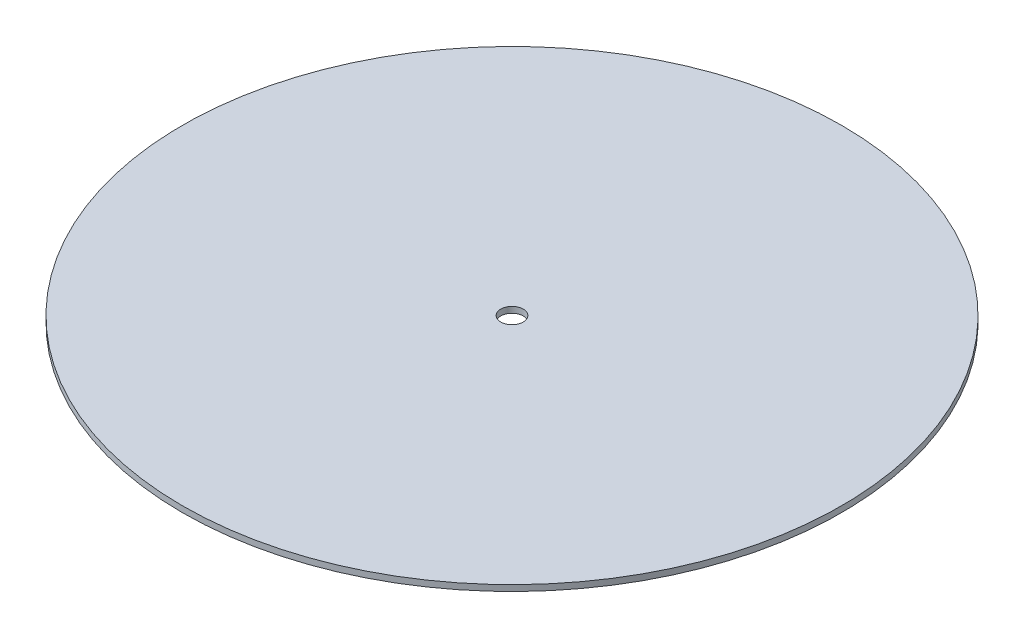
ISO-10303-21;
HEADER;
FILE_DESCRIPTION(('STEP AP214'),'2;1');
FILE_NAME('part.step','',(''),(''),'','','');
FILE_SCHEMA(('AUTOMOTIVE_DESIGN { 1 0 10303 214 1 1 1 1 }'));
ENDSEC;
DATA;
#1=APPLICATION_CONTEXT('core data for automotive mechanical design processes');
#2=APPLICATION_PROTOCOL_DEFINITION('international standard','automotive_design',2000,#1);
#3=PRODUCT_CONTEXT('',#1,'mechanical');
#4=PRODUCT('Part','Part','',(#3));
#5=PRODUCT_RELATED_PRODUCT_CATEGORY('part','',(#4));
#6=PRODUCT_DEFINITION_FORMATION('','',#4);
#7=PRODUCT_DEFINITION_CONTEXT('part definition',#1,'design');
#8=PRODUCT_DEFINITION('design','',#6,#7);
#9=PRODUCT_DEFINITION_SHAPE('','',#8);
#10=(LENGTH_UNIT() NAMED_UNIT(*) SI_UNIT(.MILLI.,.METRE.));
#11=(NAMED_UNIT(*) PLANE_ANGLE_UNIT() SI_UNIT($,.RADIAN.));
#12=(NAMED_UNIT(*) SI_UNIT($,.STERADIAN.) SOLID_ANGLE_UNIT());
#13=UNCERTAINTY_MEASURE_WITH_UNIT(LENGTH_MEASURE(1.E-05),#10,'distance_accuracy_value','');
#14=(GEOMETRIC_REPRESENTATION_CONTEXT(3) GLOBAL_UNCERTAINTY_ASSIGNED_CONTEXT((#13)) GLOBAL_UNIT_ASSIGNED_CONTEXT((#10,
#11,#12)) REPRESENTATION_CONTEXT('',''));
#15=CARTESIAN_POINT('',(0.,0.,0.));
#16=DIRECTION('',(0.,0.,1.));
#17=DIRECTION('',(1.,0.,0.));
#18=AXIS2_PLACEMENT_3D('',#15,#16,#17);
#19=CARTESIAN_POINT('',(0.,1.,0.));
#20=DIRECTION('',(0.,1.,0.));
#21=DIRECTION('',(0.,0.,1.));
#22=AXIS2_PLACEMENT_3D('',#19,#20,#21);
#23=PLANE('',#22);
#24=CARTESIAN_POINT('',(0.,1.,0.));
#25=DIRECTION('',(0.,1.,0.));
#26=DIRECTION('',(0.,0.,1.));
#27=AXIS2_PLACEMENT_3D('',#24,#25,#26);
#28=CIRCLE('',#27,110.);
#29=CARTESIAN_POINT('',(0.,1.,110.));
#30=VERTEX_POINT('',#29);
#31=EDGE_CURVE('E10',#30,#30,#28,.T.);
#32=ORIENTED_EDGE('',*,*,#31,.T.);
#33=EDGE_LOOP('',(#32));
#34=FACE_BOUND('',#33,.T.);
#35=CARTESIAN_POINT('',(0.,1.,0.));
#36=DIRECTION('',(0.,1.,0.));
#37=DIRECTION('',(0.,0.,1.));
#38=AXIS2_PLACEMENT_3D('',#35,#36,#37);
#39=CIRCLE('',#38,3.75);
#40=CARTESIAN_POINT('',(0.,1.,3.75));
#41=VERTEX_POINT('',#40);
#42=EDGE_CURVE('E42',#41,#41,#39,.T.);
#43=ORIENTED_EDGE('',*,*,#42,.F.);
#44=EDGE_LOOP('',(#43));
#45=FACE_BOUND('',#44,.T.);
#46=ADVANCED_FACE('F31',(#34,#45),#23,.T.);
#47=CARTESIAN_POINT('',(0.,-1.,0.));
#48=DIRECTION('',(0.,1.,0.));
#49=DIRECTION('',(0.,0.,1.));
#50=AXIS2_PLACEMENT_3D('',#47,#48,#49);
#51=PLANE('',#50);
#52=CARTESIAN_POINT('',(0.,-1.,0.));
#53=DIRECTION('',(0.,1.,0.));
#54=DIRECTION('',(0.,0.,1.));
#55=AXIS2_PLACEMENT_3D('',#52,#53,#54);
#56=CIRCLE('',#55,110.);
#57=CARTESIAN_POINT('',(0.,-1.,110.));
#58=VERTEX_POINT('',#57);
#59=EDGE_CURVE('E35',#58,#58,#56,.T.);
#60=ORIENTED_EDGE('',*,*,#59,.F.);
#61=EDGE_LOOP('',(#60));
#62=FACE_BOUND('',#61,.T.);
#63=CARTESIAN_POINT('',(0.,-1.,0.));
#64=DIRECTION('',(0.,1.,0.));
#65=DIRECTION('',(0.,0.,1.));
#66=AXIS2_PLACEMENT_3D('',#63,#64,#65);
#67=CIRCLE('',#66,3.75);
#68=CARTESIAN_POINT('',(0.,-1.,3.75));
#69=VERTEX_POINT('',#68);
#70=EDGE_CURVE('E44',#69,#69,#67,.T.);
#71=ORIENTED_EDGE('',*,*,#70,.T.);
#72=EDGE_LOOP('',(#71));
#73=FACE_BOUND('',#72,.T.);
#74=ADVANCED_FACE('F54',(#62,#73),#51,.F.);
#75=CARTESIAN_POINT('',(0.,1.,0.));
#76=DIRECTION('',(0.,-1.,0.));
#77=DIRECTION('',(0.,0.,-1.));
#78=AXIS2_PLACEMENT_3D('',#75,#76,#77);
#79=CYLINDRICAL_SURFACE('',#78,110.);
#80=ORIENTED_EDGE('',*,*,#31,.F.);
#81=EDGE_LOOP('',(#80));
#82=FACE_BOUND('',#81,.T.);
#83=ORIENTED_EDGE('',*,*,#59,.T.);
#84=EDGE_LOOP('',(#83));
#85=FACE_BOUND('',#84,.T.);
#86=ADVANCED_FACE('F33',(#82,#85),#79,.T.);
#87=CARTESIAN_POINT('',(0.,1.,0.));
#88=DIRECTION('',(0.,-1.,0.));
#89=DIRECTION('',(0.,0.,-1.));
#90=AXIS2_PLACEMENT_3D('',#87,#88,#89);
#91=CYLINDRICAL_SURFACE('',#90,3.75);
#92=ORIENTED_EDGE('',*,*,#42,.T.);
#93=EDGE_LOOP('',(#92));
#94=FACE_BOUND('',#93,.T.);
#95=ORIENTED_EDGE('',*,*,#70,.F.);
#96=EDGE_LOOP('',(#95));
#97=FACE_BOUND('',#96,.T.);
#98=ADVANCED_FACE('F50',(#94,#97),#91,.F.);
#99=CLOSED_SHELL('',(#46,#74,#86,#98));
#100=MANIFOLD_SOLID_BREP('B2',#99);
#101=ADVANCED_BREP_SHAPE_REPRESENTATION('',(#18,#100),#14);
#102=SHAPE_DEFINITION_REPRESENTATION(#9,#101);
ENDSEC;
END-ISO-10303-21;
